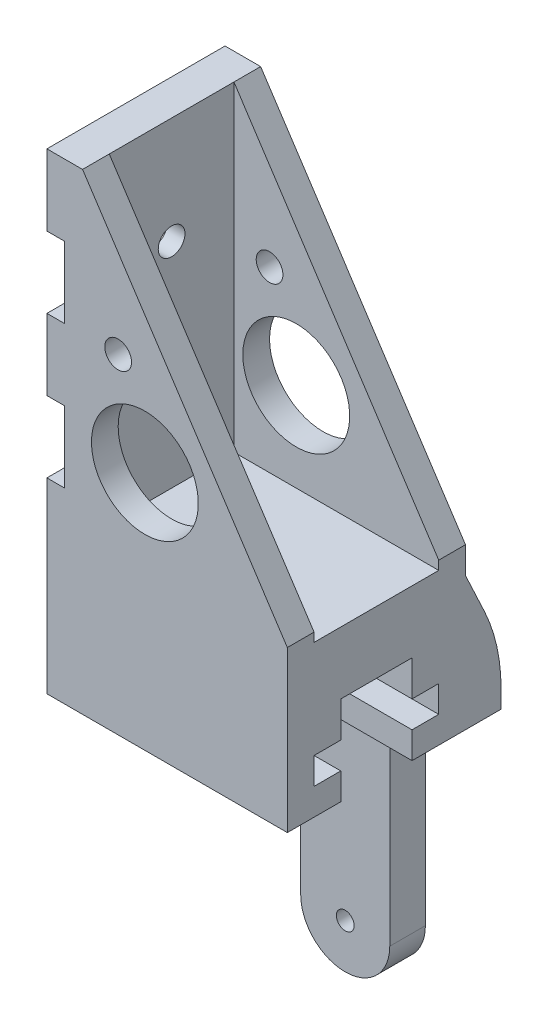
from build123d import *

# Parameters (mm, degrees)
EXTRUDE_1_DEPTH     = 10
SHELL_1_T           = -3
CUT_EXTRUDE_1_DEPTH = 7
SKETCH_3_W          = 2
SKETCH_3_H          = 8
SKETCH_3_H_2        = 6
EXTRUDE_2_DEPTH     = 10
SKETCH_4_R          = 6
SKETCH_4_R_2        = 1.5
CUT_EXTRUDE_2_DEPTH = 20
SKETCH_5_R          = 1.5
CUT_EXTRUDE_3_DEPTH = 20
EXTRUDE_3_DEPTH     = 27
SKETCH_7_R          = 1
EXTRUDE_4_DEPTH     = 4
EXTRUDE_5_DEPTH     = 4
SKETCH_9_R          = 1
EXTRUDE_6_DEPTH     = 4
SKETCH_10_R         = 1
CUT_EXTRUDE_4_DEPTH = 4


with BuildPart() as part:
    # Sketch 1 → Extrude 1 (new, symmetric)
    with BuildSketch(Plane.XY):
        Polygon((0, 0), (2, 0), (25, -35), (25, -38), (0, -38), align=None)
    extrude(amount=EXTRUDE_1_DEPTH, both=True)

    # Shell 1
    shell_1_openings = [part.faces().sort_by_distance(p)[0] for p in [
        (13.5, -17.5, 0),
    ]]
    offset(amount=SHELL_1_T, openings=shell_1_openings, kind=Kind.INTERSECTION)

    # Sketch 2 → Cut-Extrude 1 (cut, symmetric)
    with BuildSketch(Plane.XY):
        Polygon((2, 0), (2, -36), (25, -36), (25, -35), (22, -30.434782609), (22, -35), (3, -35), (3, -3), (3.971428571, -3), align=None)
    extrude(amount=CUT_EXTRUDE_1_DEPTH, both=True, mode=Mode.SUBTRACT)

    # Sketch 3 → Extrude 2 (add, symmetric)
    with BuildSketch(Plane.XY):
        with Locations((-1, -4)):
            Rectangle(SKETCH_3_W, SKETCH_3_H)
        with Locations((-1, -20)):
            Rectangle(SKETCH_3_W, SKETCH_3_H)
        with Locations((-1, -35)):
            Rectangle(SKETCH_3_W, SKETCH_3_H_2)
    extrude(amount=EXTRUDE_2_DEPTH, both=True)

    # Sketch 4 → Cut-Extrude 2 (cut)
    with BuildSketch(Plane(origin=(0, 0, -10), x_dir=(-1, 0, 0), z_dir=(0, 0, -1))):
        with Locations((-9, -26)):
            Circle(SKETCH_4_R)
        with Locations((-6, -16)):
            Circle(SKETCH_4_R_2)
    extrude(amount=-CUT_EXTRUDE_2_DEPTH, mode=Mode.SUBTRACT)

    # Sketch 5 → Cut-Extrude 3 (cut)
    with BuildSketch(Plane.ZY):
        with Locations((0, -12)):
            Circle(SKETCH_5_R)
        with Locations((0, -28)):
            Circle(SKETCH_5_R)
    extrude(amount=-CUT_EXTRUDE_3_DEPTH, mode=Mode.SUBTRACT)

    # Sketch 6 → Extrude 3 (add)
    with BuildSketch(Plane(origin=(25, 0, 0), x_dir=(0, 0, -1), z_dir=(1, 0, 0))):
        with BuildLine():
            Line((-10, -38), (-10, -53))
            Line((-10, -53), (-4, -53))
            Line((-4, -53), (-4, -50))
            Line((-4, -50), (-7, -50))
            Line((-7, -50), (-7, -47))
            Line((-7, -47), (-4, -47))
            Line((-4, -47), (-4, -43))
            Line((-4, -43), (4, -43))
            Line((4, -43), (4, -47))
            Line((4, -47), (7, -47))
            Line((7, -47), (7, -50))
            Line((7, -50), (4, -50))
            Line((4, -50), (4, -53))
            Line((4, -53), (14, -53))
            Line((14, -53), (14, -51))
            ThreePointArc((14, -51), (13.523741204, -46.661390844), (12.117647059, -42.529411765))
            Line((12.117647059, -42.529411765), (10, -38))
            Line((10, -38), (-10, -38))
        make_face()
    extrude(amount=-EXTRUDE_3_DEPTH)

    # Sketch 7 → Extrude 4 (add)
    with BuildSketch(Plane(origin=(0, 0, -14), x_dir=(-1, 0, 0), z_dir=(0, 0, -1))):
        with BuildLine():
            Line((-6.5, -53), (-6.5, -73))
            ThreePointArc((-6.5, -73), (-11.5, -78), (-16.5, -73))
            Line((-16.5, -73), (-16.5, -53))
            Line((-16.5, -53), (-6.5, -53))
        make_face()
        with Locations(Location((-11.5, -73, 0), (0, 0, 90))):
            Circle(SKETCH_7_R, mode=Mode.SUBTRACT)
    extrude(amount=-EXTRUDE_4_DEPTH)

    # Sketch 8 → Extrude 5 (add)
    with BuildSketch(Plane(origin=(0, 0, -14), x_dir=(-1, 0, 0), z_dir=(0, 0, -1))):
        with BuildLine():
            Line((-16.5, -73), (-16.5, -78.3))
            ThreePointArc((-16.5, -78.3), (-11.5, -83.3), (-6.5, -78.3))
            Line((-6.5, -78.3), (-6.5, -73))
            ThreePointArc((-6.5, -73), (-11.5, -78), (-16.5, -73))
        make_face()
    extrude(amount=-EXTRUDE_5_DEPTH)

    # Sketch 9 → Extrude 6 (add)
    with BuildSketch(Plane(origin=(0, 0, -14), x_dir=(-1, 0, 0), z_dir=(0, 0, -1))):
        with Locations((-11.5, -73)):
            Circle(SKETCH_9_R)
    extrude(amount=-EXTRUDE_6_DEPTH)

    # Sketch 10 → Cut-Extrude 4 (cut)
    with BuildSketch(Plane(origin=(0, 0, -14), x_dir=(-1, 0, 0), z_dir=(0, 0, -1))):
        with Locations(Location((-11.5, -78.3, 0), (0, 0, 90))):
            Circle(SKETCH_10_R)
    extrude(amount=-CUT_EXTRUDE_4_DEPTH, mode=Mode.SUBTRACT)


solid = part.part
